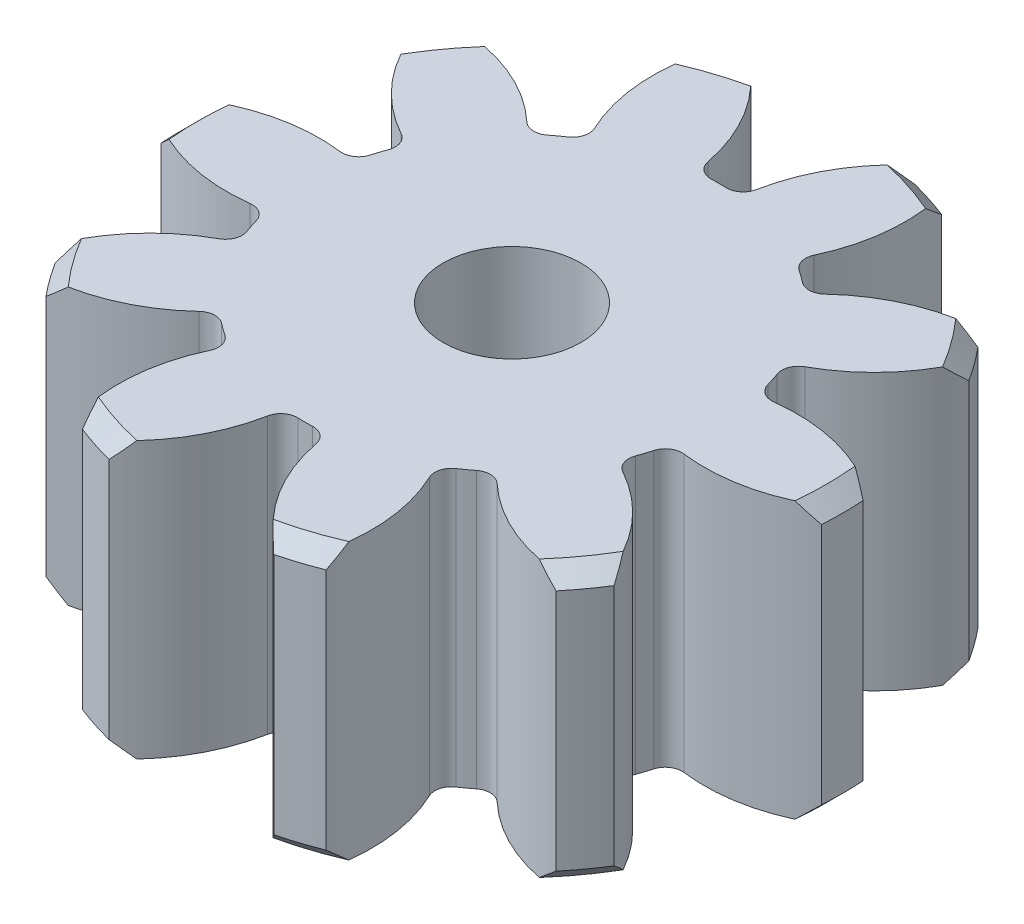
from build123d import *

# Parameters (mm, degrees)
SKETCH1_R                = 12
BOSS_EXTRUDE1_DEPTH      = 10
CUT_EXTRUDE1_DEPTH       = 10
FILLET1_R                = 0.6
CHAMFER1_SIZE            = 0.6
CIRPATTERN1_COUNT        = 10
FILLET1_OF_CIRPATTERN1_R = 0.6
SKETCH3_R                = 2.5
CUT_EXTRUDE2_DEPTH       = 10


with BuildPart() as part:
    # Sketch1 → Boss-Extrude1 (new body)
    with BuildSketch(Plane(origin=(0, 0, 0), x_dir=(1, 0, 0), z_dir=(0, 1, 0))):
        with Locations(Location((0, 0, 0), (0, 0, 270))):
            Circle(SKETCH1_R)
    extrude(amount=BOSS_EXTRUDE1_DEPTH)

    # Sketch2 → Cut-Extrude1 (cut)
    with BuildSketch(Plane.XZ):
        with BuildLine():
            ThreePointArc((-2.984989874, 11.622815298), (-1.495016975, 9.748374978), (-0.798815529, 7.457338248))
            ThreePointArc((-0.798815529, 7.457338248), (0, 7.5), (0.798815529, 7.457338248))
            ThreePointArc((0.798815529, 7.457338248), (1.495016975, 9.748374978), (2.984989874, 11.622815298))
            ThreePointArc((2.984989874, 11.622815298), (0, 12), (-2.984989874, 11.622815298))
        make_face()
    cut_extrude1 = extrude(amount=-CUT_EXTRUDE1_DEPTH, mode=Mode.SUBTRACT)

    # Fillet1
    fillet1_edges = [part.edges().sort_by_distance(p)[0] for p in [
        (-0.798815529, 5, 7.457338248),
        (0.798815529, 5, 7.457338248),
    ]]
    fillet(fillet1_edges, radius=FILLET1_R)

    # Chamfer1
    chamfer1_edges = [part.edges().sort_by_distance(p)[0] for p in [
        (0, 0, -12),
        (0, 10, -12),
    ]]
    chamfer(chamfer1_edges, length=CHAMFER1_SIZE)

    # CirPattern1: Cut-Extrude1 ×10 about axis
    cirpattern1_axis = Axis((0, 0, 0), (0, 1, 0))
    for i in range(1, CIRPATTERN1_COUNT):
        add(cut_extrude1.rotate(cirpattern1_axis, i * 360 / CIRPATTERN1_COUNT), mode=Mode.SUBTRACT)

    # Fillet1 of CirPattern1
    fillet1_of_cirpattern1_edges = [part.edges().sort_by_distance(p)[0] for p in [
        (3.737058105, 5, 6.502645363),
        (5.029568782, 5, 5.563581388),
        (6.845502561, 5, 3.064162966),
        (7.339197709, 5, 1.544725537),
        (7.339197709, 5, -1.544725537),
        (6.845502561, 5, -3.064162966),
        (5.029568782, 5, -5.563581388),
        (3.737058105, 5, -6.502645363),
        (0.798815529, 5, -7.457338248),
        (-0.798815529, 5, -7.457338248),
        (-3.737058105, 5, -6.502645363),
        (-5.029568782, 5, -5.563581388),
        (-6.845502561, 5, -3.064162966),
        (-7.339197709, 5, -1.544725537),
        (-7.339197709, 5, 1.544725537),
        (-6.845502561, 5, 3.064162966),
        (-5.029568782, 5, 5.563581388),
        (-3.737058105, 5, 6.502645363),
    ]]
    fillet(fillet1_of_cirpattern1_edges, radius=FILLET1_OF_CIRPATTERN1_R)

    # Sketch3 → Cut-Extrude2 (cut)
    with BuildSketch(Plane.XZ):
        with Locations(Location((0, 0, 0), (0, 0, 270))):
            Circle(SKETCH3_R)
    extrude(amount=-CUT_EXTRUDE2_DEPTH, mode=Mode.SUBTRACT)


solid = part.part
